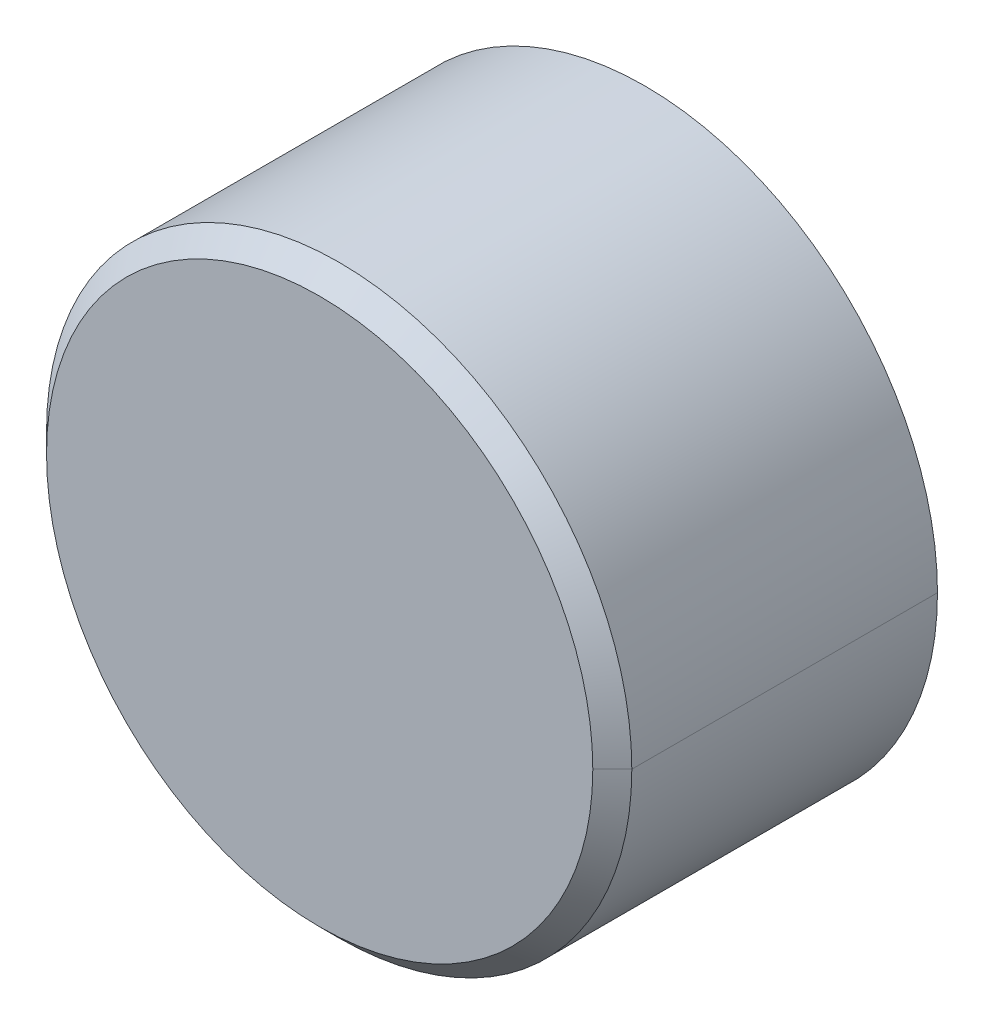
ISO-10303-21;
HEADER;
FILE_DESCRIPTION(('STEP AP214'),'2;1');
FILE_NAME('part.step','',(''),(''),'','','');
FILE_SCHEMA(('AUTOMOTIVE_DESIGN { 1 0 10303 214 1 1 1 1 }'));
ENDSEC;
DATA;
#1=APPLICATION_CONTEXT('core data for automotive mechanical design processes');
#2=APPLICATION_PROTOCOL_DEFINITION('international standard','automotive_design',2000,#1);
#3=PRODUCT_CONTEXT('',#1,'mechanical');
#4=PRODUCT('Part','Part','',(#3));
#5=PRODUCT_RELATED_PRODUCT_CATEGORY('part','',(#4));
#6=PRODUCT_DEFINITION_FORMATION('','',#4);
#7=PRODUCT_DEFINITION_CONTEXT('part definition',#1,'design');
#8=PRODUCT_DEFINITION('design','',#6,#7);
#9=PRODUCT_DEFINITION_SHAPE('','',#8);
#10=(LENGTH_UNIT() NAMED_UNIT(*) SI_UNIT(.MILLI.,.METRE.));
#11=(NAMED_UNIT(*) PLANE_ANGLE_UNIT() SI_UNIT($,.RADIAN.));
#12=(NAMED_UNIT(*) SI_UNIT($,.STERADIAN.) SOLID_ANGLE_UNIT());
#13=UNCERTAINTY_MEASURE_WITH_UNIT(LENGTH_MEASURE(1.E-05),#10,'distance_accuracy_value','');
#14=(GEOMETRIC_REPRESENTATION_CONTEXT(3) GLOBAL_UNCERTAINTY_ASSIGNED_CONTEXT((#13)) GLOBAL_UNIT_ASSIGNED_CONTEXT((#10,
#11,#12)) REPRESENTATION_CONTEXT('',''));
#15=CARTESIAN_POINT('',(0.,0.,0.));
#16=DIRECTION('',(0.,0.,1.));
#17=DIRECTION('',(1.,0.,0.));
#18=AXIS2_PLACEMENT_3D('',#15,#16,#17);
#19=CARTESIAN_POINT('',(0.,-3.799999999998,20.9));
#20=DIRECTION('',(0.,0.,1.));
#21=DIRECTION('',(1.,0.,0.));
#22=AXIS2_PLACEMENT_3D('',#19,#20,#21);
#23=PLANE('',#22);
#24=CARTESIAN_POINT('',(0.,0.,20.9));
#25=DIRECTION('',(0.,0.,1.));
#26=DIRECTION('',(1.,0.,0.));
#27=AXIS2_PLACEMENT_3D('',#24,#25,#26);
#28=CIRCLE('',#27,2.25);
#29=CARTESIAN_POINT('',(2.25,0.,20.9));
#30=VERTEX_POINT('',#29);
#31=CARTESIAN_POINT('',(-2.25,0.,20.9));
#32=VERTEX_POINT('',#31);
#33=EDGE_CURVE('E122',#30,#32,#28,.T.);
#34=ORIENTED_EDGE('',*,*,#33,.F.);
#35=CARTESIAN_POINT('',(0.,0.,20.9));
#36=DIRECTION('',(0.,0.,1.));
#37=DIRECTION('',(-1.,0.,0.));
#38=AXIS2_PLACEMENT_3D('',#35,#36,#37);
#39=CIRCLE('',#38,2.25);
#40=EDGE_CURVE('E135',#32,#30,#39,.T.);
#41=ORIENTED_EDGE('',*,*,#40,.F.);
#42=EDGE_LOOP('',(#34,#41));
#43=FACE_BOUND('',#42,.T.);
#44=ADVANCED_FACE('F48',(#43),#23,.F.);
#45=CARTESIAN_POINT('',(0.,0.,23.4));
#46=DIRECTION('',(0.,0.,1.));
#47=DIRECTION('',(1.,0.,0.));
#48=AXIS2_PLACEMENT_3D('',#45,#46,#47);
#49=PLANE('',#48);
#50=CARTESIAN_POINT('',(0.,0.,23.4));
#51=DIRECTION('',(0.,0.,-1.));
#52=DIRECTION('',(0.,1.,0.));
#53=AXIS2_PLACEMENT_3D('',#50,#51,#52);
#54=CIRCLE('',#53,2.099999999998);
#55=CARTESIAN_POINT('',(0.,2.099999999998,23.4));
#56=VERTEX_POINT('',#55);
#57=CARTESIAN_POINT('',(2.099999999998,0.,23.4));
#58=VERTEX_POINT('',#57);
#59=EDGE_CURVE('E129',#56,#58,#54,.T.);
#60=ORIENTED_EDGE('',*,*,#59,.F.);
#61=CARTESIAN_POINT('',(0.,0.,23.4));
#62=DIRECTION('',(0.,0.,-1.));
#63=DIRECTION('',(-1.,0.,0.));
#64=AXIS2_PLACEMENT_3D('',#61,#62,#63);
#65=CIRCLE('',#64,2.099999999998);
#66=CARTESIAN_POINT('',(-2.099999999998,0.,23.4));
#67=VERTEX_POINT('',#66);
#68=EDGE_CURVE('E106',#67,#56,#65,.T.);
#69=ORIENTED_EDGE('',*,*,#68,.F.);
#70=CARTESIAN_POINT('',(0.,0.,23.4));
#71=DIRECTION('',(0.,0.,-1.));
#72=DIRECTION('',(0.,-1.,0.));
#73=AXIS2_PLACEMENT_3D('',#70,#71,#72);
#74=CIRCLE('',#73,2.099999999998);
#75=CARTESIAN_POINT('',(0.,-2.099999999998,23.4));
#76=VERTEX_POINT('',#75);
#77=EDGE_CURVE('E101',#76,#67,#74,.T.);
#78=ORIENTED_EDGE('',*,*,#77,.F.);
#79=CARTESIAN_POINT('',(0.,0.,23.4));
#80=DIRECTION('',(0.,0.,-1.));
#81=DIRECTION('',(1.,0.,0.));
#82=AXIS2_PLACEMENT_3D('',#79,#80,#81);
#83=CIRCLE('',#82,2.099999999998);
#84=EDGE_CURVE('E94',#58,#76,#83,.T.);
#85=ORIENTED_EDGE('',*,*,#84,.F.);
#86=EDGE_LOOP('',(#60,#69,#78,#85));
#87=FACE_BOUND('',#86,.T.);
#88=ADVANCED_FACE('F148',(#87),#49,.T.);
#89=CARTESIAN_POINT('',(0.,0.,23.325));
#90=DIRECTION('',(0.,0.,-1.));
#91=DIRECTION('',(0.,-1.,0.));
#92=AXIS2_PLACEMENT_3D('',#89,#90,#91);
#93=CONICAL_SURFACE('',#92,2.174999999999,0.7853981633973);
#94=DIRECTION('',(-0.707106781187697,-1.42343445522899E-08,0.707106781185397));
#95=VECTOR('',#94,1.);
#96=CARTESIAN_POINT('',(2.249999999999,-1.235274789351E-08,23.25));
#97=LINE('',#96,#95);
#98=CARTESIAN_POINT('',(2.249999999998,0.,23.25));
#99=VERTEX_POINT('',#98);
#100=EDGE_CURVE('E107',#99,#58,#97,.T.);
#101=ORIENTED_EDGE('',*,*,#100,.F.);
#102=CARTESIAN_POINT('',(0.,0.,23.25));
#103=DIRECTION('',(0.,0.,-1.));
#104=DIRECTION('',(0.,1.,0.));
#105=AXIS2_PLACEMENT_3D('',#102,#103,#104);
#106=CIRCLE('',#105,2.249999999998);
#107=CARTESIAN_POINT('',(0.,2.249999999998,23.25));
#108=VERTEX_POINT('',#107);
#109=EDGE_CURVE('E114',#108,#99,#106,.T.);
#110=ORIENTED_EDGE('',*,*,#109,.F.);
#111=CARTESIAN_POINT('',(0.,0.,23.25));
#112=DIRECTION('',(0.,0.,-1.));
#113=DIRECTION('',(-1.,4.72650819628E-09,0.));
#114=AXIS2_PLACEMENT_3D('',#111,#112,#113);
#115=CIRCLE('',#114,2.249999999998);
#116=CARTESIAN_POINT('',(-2.249999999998,1.063464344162E-08,23.25));
#117=VERTEX_POINT('',#116);
#118=EDGE_CURVE('E110',#117,#108,#115,.T.);
#119=ORIENTED_EDGE('',*,*,#118,.F.);
#120=DIRECTION('',(0.707106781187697,-1.083174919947E-08,0.707106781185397));
#121=VECTOR('',#120,1.);
#122=CARTESIAN_POINT('',(-2.249999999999,1.767006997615E-08,23.25));
#123=LINE('',#122,#121);
#124=EDGE_CURVE('E97',#117,#67,#123,.T.);
#125=ORIENTED_EDGE('',*,*,#124,.T.);
#126=ORIENTED_EDGE('',*,*,#68,.T.);
#127=ORIENTED_EDGE('',*,*,#59,.T.);
#128=EDGE_LOOP('',(#101,#110,#119,#125,#126,#127));
#129=FACE_BOUND('',#128,.T.);
#130=ADVANCED_FACE('F112',(#129),#93,.T.);
#131=CARTESIAN_POINT('',(0.,0.,23.325));
#132=DIRECTION('',(0.,0.,-1.));
#133=DIRECTION('',(0.,-1.,0.));
#134=AXIS2_PLACEMENT_3D('',#131,#132,#133);
#135=CONICAL_SURFACE('',#134,2.174999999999,0.7853981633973);
#136=ORIENTED_EDGE('',*,*,#124,.F.);
#137=CARTESIAN_POINT('',(0.,0.,23.25));
#138=DIRECTION('',(0.,0.,-1.));
#139=DIRECTION('',(0.,-1.,0.));
#140=AXIS2_PLACEMENT_3D('',#137,#138,#139);
#141=CIRCLE('',#140,2.249999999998);
#142=CARTESIAN_POINT('',(0.,-2.249999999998,23.25));
#143=VERTEX_POINT('',#142);
#144=EDGE_CURVE('E58',#143,#117,#141,.T.);
#145=ORIENTED_EDGE('',*,*,#144,.F.);
#146=CARTESIAN_POINT('',(0.,0.,23.25));
#147=DIRECTION('',(0.,0.,-1.));
#148=DIRECTION('',(1.,0.,0.));
#149=AXIS2_PLACEMENT_3D('',#146,#147,#148);
#150=CIRCLE('',#149,2.249999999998);
#151=EDGE_CURVE('E11',#99,#143,#150,.T.);
#152=ORIENTED_EDGE('',*,*,#151,.F.);
#153=ORIENTED_EDGE('',*,*,#100,.T.);
#154=ORIENTED_EDGE('',*,*,#84,.T.);
#155=ORIENTED_EDGE('',*,*,#77,.T.);
#156=EDGE_LOOP('',(#136,#145,#152,#153,#154,#155));
#157=FACE_BOUND('',#156,.T.);
#158=ADVANCED_FACE('F99',(#157),#135,.T.);
#159=CARTESIAN_POINT('',(0.,0.,20.9));
#160=DIRECTION('',(0.,0.,1.));
#161=DIRECTION('',(1.,0.,0.));
#162=AXIS2_PLACEMENT_3D('',#159,#160,#161);
#163=CYLINDRICAL_SURFACE('',#162,2.25);
#164=DIRECTION('',(3.193662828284E-13,5.256488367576E-09,-1.));
#165=VECTOR('',#164,1.);
#166=CARTESIAN_POINT('',(2.249999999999,-1.235274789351E-08,23.25));
#167=LINE('',#166,#165);
#168=EDGE_CURVE('E51',#99,#30,#167,.T.);
#169=ORIENTED_EDGE('',*,*,#168,.T.);
#170=ORIENTED_EDGE('',*,*,#33,.T.);
#171=DIRECTION('',(-3.193662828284E-13,-4.502258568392E-09,-1.));
#172=VECTOR('',#171,1.);
#173=CARTESIAN_POINT('',(-2.249999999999,1.767006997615E-08,23.25));
#174=LINE('',#173,#172);
#175=EDGE_CURVE('E91',#117,#32,#174,.T.);
#176=ORIENTED_EDGE('',*,*,#175,.F.);
#177=ORIENTED_EDGE('',*,*,#118,.T.);
#178=ORIENTED_EDGE('',*,*,#109,.T.);
#179=EDGE_LOOP('',(#169,#170,#176,#177,#178));
#180=FACE_BOUND('',#179,.T.);
#181=ADVANCED_FACE('F120',(#180),#163,.T.);
#182=CARTESIAN_POINT('',(0.,0.,20.9));
#183=DIRECTION('',(0.,0.,1.));
#184=DIRECTION('',(1.,0.,0.));
#185=AXIS2_PLACEMENT_3D('',#182,#183,#184);
#186=CYLINDRICAL_SURFACE('',#185,2.25);
#187=ORIENTED_EDGE('',*,*,#175,.T.);
#188=ORIENTED_EDGE('',*,*,#40,.T.);
#189=ORIENTED_EDGE('',*,*,#168,.F.);
#190=ORIENTED_EDGE('',*,*,#151,.T.);
#191=ORIENTED_EDGE('',*,*,#144,.T.);
#192=EDGE_LOOP('',(#187,#188,#189,#190,#191));
#193=FACE_BOUND('',#192,.T.);
#194=ADVANCED_FACE('F89',(#193),#186,.T.);
#195=CLOSED_SHELL('',(#44,#88,#130,#158,#181,#194));
#196=MANIFOLD_SOLID_BREP('B2',#195);
#197=ADVANCED_BREP_SHAPE_REPRESENTATION('',(#18,#196),#14);
#198=SHAPE_DEFINITION_REPRESENTATION(#9,#197);
ENDSEC;
END-ISO-10303-21;
